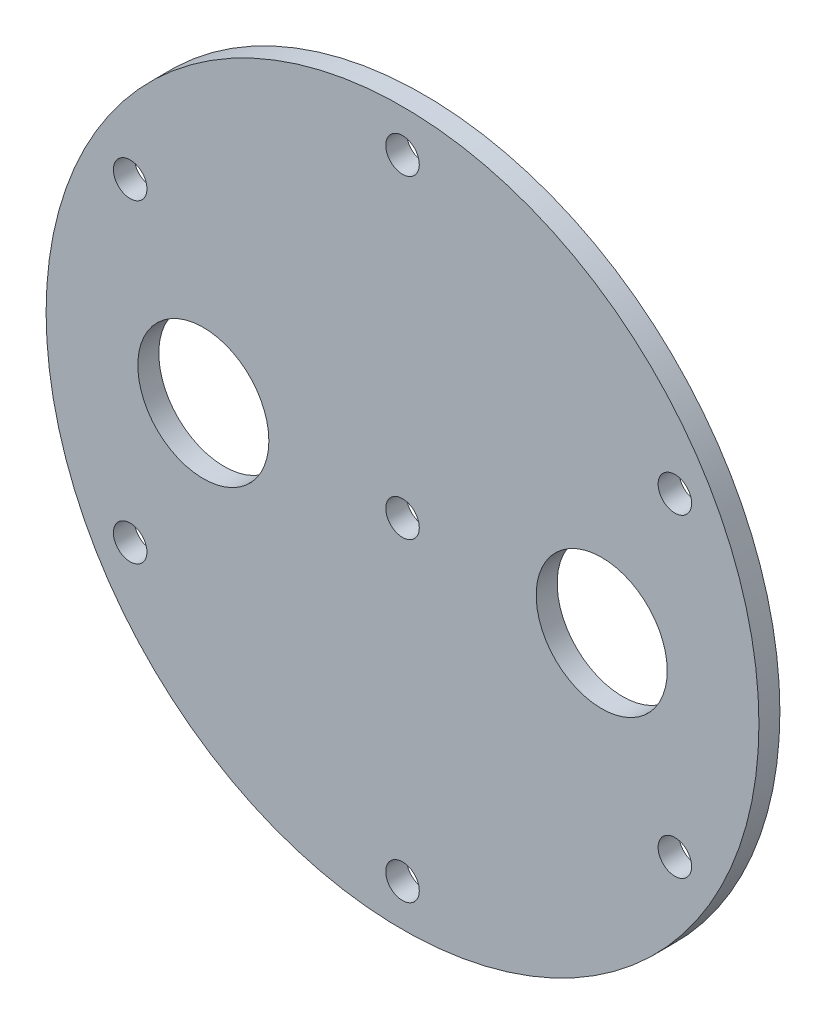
from build123d import *

# Parameters (mm, degrees)
SKIZZE1_R                        = 34
LINEAR_AUSTRAGEN1_DEPTH          = 2
F_3_2_3_2_DURCHMESSER_BOHRUNG1_D = 3.2
KREISMUSTER1_COUNT               = 6
SKIZZE5_R                        = 1.6
SKIZZE5_R_2                      = 6.25
LINEAR_AUSTRAGEN2_DEPTH          = 49.124837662


with BuildPart() as part:
    # Skizze1 → Linear austragen1 (new body)
    with BuildSketch(Plane.XY):
        Circle(SKIZZE1_R)
    extrude(amount=-LINEAR_AUSTRAGEN1_DEPTH)

    # 3.2 _3.2_ Durchmesser Bohrung1 (through all)
    with Locations(Plane.XY):
        with Locations((0, 30)):
            f_3_2_3_2_durchmesser_bohrung1 = Hole(F_3_2_3_2_DURCHMESSER_BOHRUNG1_D / 2)

    # Kreismuster1: 3.2 _3.2_ Durchmesser Bohrung1 ×6 about axis
    kreismuster1_axis = Axis((0, 0, 0), (0, 0, 1))
    for i in range(1, KREISMUSTER1_COUNT):
        add(f_3_2_3_2_durchmesser_bohrung1.rotate(kreismuster1_axis, i * 360 / KREISMUSTER1_COUNT), mode=Mode.SUBTRACT)

    # Skizze5 → Linear austragen2 (cut, through all)
    with BuildSketch(Plane.XY):
        Circle(SKIZZE5_R)
        with Locations((-19, 0)):
            Circle(SKIZZE5_R_2)
        with Locations((19, 0)):
            Circle(SKIZZE5_R_2)
    extrude(amount=-LINEAR_AUSTRAGEN2_DEPTH, mode=Mode.SUBTRACT)


solid = part.part
